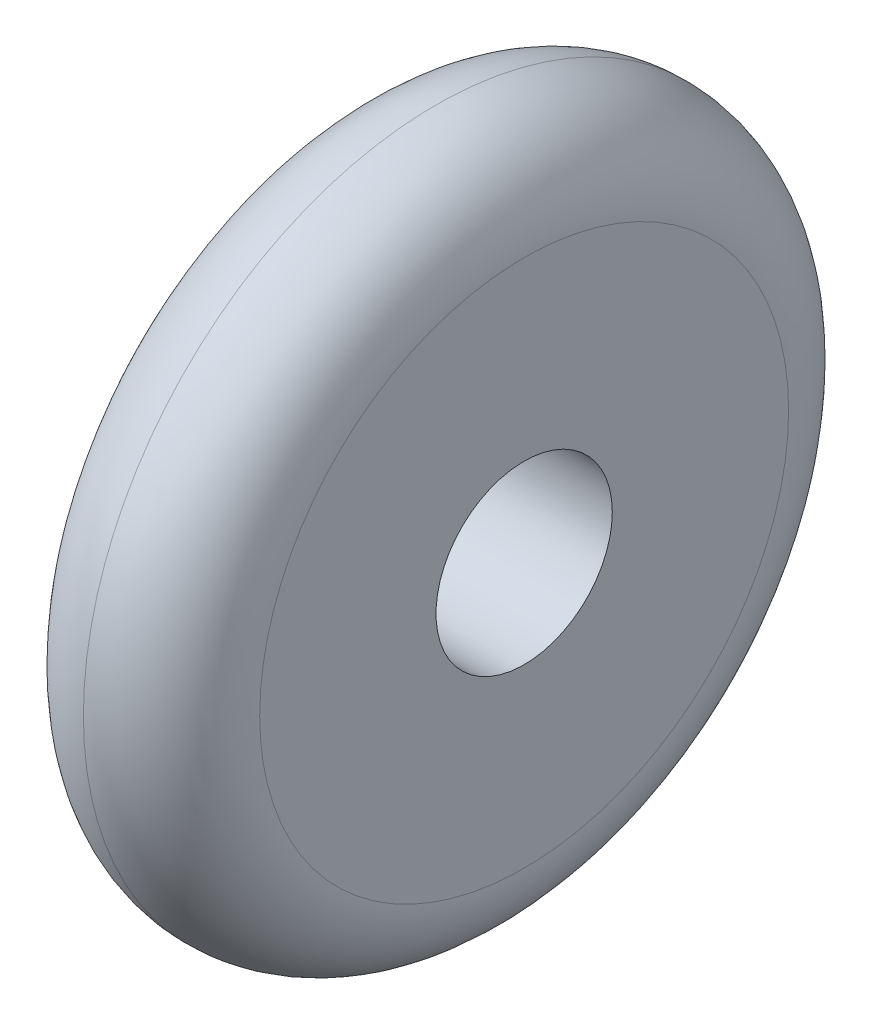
ISO-10303-21;
HEADER;
FILE_DESCRIPTION(('STEP AP214'),'2;1');
FILE_NAME('part.step','',(''),(''),'','','');
FILE_SCHEMA(('AUTOMOTIVE_DESIGN { 1 0 10303 214 1 1 1 1 }'));
ENDSEC;
DATA;
#1=APPLICATION_CONTEXT('core data for automotive mechanical design processes');
#2=APPLICATION_PROTOCOL_DEFINITION('international standard','automotive_design',2000,#1);
#3=PRODUCT_CONTEXT('',#1,'mechanical');
#4=PRODUCT('Part','Part','',(#3));
#5=PRODUCT_RELATED_PRODUCT_CATEGORY('part','',(#4));
#6=PRODUCT_DEFINITION_FORMATION('','',#4);
#7=PRODUCT_DEFINITION_CONTEXT('part definition',#1,'design');
#8=PRODUCT_DEFINITION('design','',#6,#7);
#9=PRODUCT_DEFINITION_SHAPE('','',#8);
#10=(LENGTH_UNIT() NAMED_UNIT(*) SI_UNIT(.MILLI.,.METRE.));
#11=(NAMED_UNIT(*) PLANE_ANGLE_UNIT() SI_UNIT($,.RADIAN.));
#12=(NAMED_UNIT(*) SI_UNIT($,.STERADIAN.) SOLID_ANGLE_UNIT());
#13=UNCERTAINTY_MEASURE_WITH_UNIT(LENGTH_MEASURE(1.E-05),#10,'distance_accuracy_value','');
#14=(GEOMETRIC_REPRESENTATION_CONTEXT(3) GLOBAL_UNCERTAINTY_ASSIGNED_CONTEXT((#13)) GLOBAL_UNIT_ASSIGNED_CONTEXT((#10,
#11,#12)) REPRESENTATION_CONTEXT('',''));
#15=CARTESIAN_POINT('',(0.,0.,0.));
#16=DIRECTION('',(0.,0.,1.));
#17=DIRECTION('',(1.,0.,0.));
#18=AXIS2_PLACEMENT_3D('',#15,#16,#17);
#19=CARTESIAN_POINT('',(6.35,0.,0.));
#20=DIRECTION('',(1.,0.,0.));
#21=DIRECTION('',(0.,0.,-1.));
#22=AXIS2_PLACEMENT_3D('',#19,#20,#21);
#23=PLANE('',#22);
#24=CARTESIAN_POINT('',(6.35,0.,0.));
#25=DIRECTION('',(1.,0.,0.));
#26=DIRECTION('',(0.,0.,-1.));
#27=AXIS2_PLACEMENT_3D('',#24,#25,#26);
#28=CIRCLE('',#27,19.05);
#29=CARTESIAN_POINT('',(6.35,0.,-19.05));
#30=VERTEX_POINT('',#29);
#31=EDGE_CURVE('E10',#30,#30,#28,.T.);
#32=ORIENTED_EDGE('',*,*,#31,.T.);
#33=EDGE_LOOP('',(#32));
#34=FACE_BOUND('',#33,.T.);
#35=CARTESIAN_POINT('',(6.35,0.,0.));
#36=DIRECTION('',(1.,0.,0.));
#37=DIRECTION('',(0.,0.,-1.));
#38=AXIS2_PLACEMENT_3D('',#35,#36,#37);
#39=CIRCLE('',#38,6.35);
#40=CARTESIAN_POINT('',(6.35,0.,-6.35));
#41=VERTEX_POINT('',#40);
#42=EDGE_CURVE('E51',#41,#41,#39,.T.);
#43=ORIENTED_EDGE('',*,*,#42,.F.);
#44=EDGE_LOOP('',(#43));
#45=FACE_BOUND('',#44,.T.);
#46=ADVANCED_FACE('F39',(#34,#45),#23,.T.);
#47=CARTESIAN_POINT('',(-6.35,0.,0.));
#48=DIRECTION('',(1.,0.,0.));
#49=DIRECTION('',(0.,0.,-1.));
#50=AXIS2_PLACEMENT_3D('',#47,#48,#49);
#51=PLANE('',#50);
#52=CARTESIAN_POINT('',(-6.35,0.,0.));
#53=DIRECTION('',(1.,0.,0.));
#54=DIRECTION('',(0.,0.,-1.));
#55=AXIS2_PLACEMENT_3D('',#52,#53,#54);
#56=CIRCLE('',#55,19.05);
#57=CARTESIAN_POINT('',(-6.35,0.,-19.05));
#58=VERTEX_POINT('',#57);
#59=EDGE_CURVE('E47',#58,#58,#56,.F.);
#60=ORIENTED_EDGE('',*,*,#59,.T.);
#61=EDGE_LOOP('',(#60));
#62=FACE_BOUND('',#61,.T.);
#63=CARTESIAN_POINT('',(-6.35,0.,0.));
#64=DIRECTION('',(1.,0.,0.));
#65=DIRECTION('',(0.,0.,-1.));
#66=AXIS2_PLACEMENT_3D('',#63,#64,#65);
#67=CIRCLE('',#66,6.35);
#68=CARTESIAN_POINT('',(-6.35,0.,-6.35));
#69=VERTEX_POINT('',#68);
#70=EDGE_CURVE('E54',#69,#69,#67,.T.);
#71=ORIENTED_EDGE('',*,*,#70,.T.);
#72=EDGE_LOOP('',(#71));
#73=FACE_BOUND('',#72,.T.);
#74=ADVANCED_FACE('F64',(#62,#73),#51,.F.);
#75=CARTESIAN_POINT('',(6.35,0.,0.));
#76=DIRECTION('',(-1.,0.,0.));
#77=DIRECTION('',(0.,0.,1.));
#78=AXIS2_PLACEMENT_3D('',#75,#76,#77);
#79=CYLINDRICAL_SURFACE('',#78,6.35);
#80=ORIENTED_EDGE('',*,*,#42,.T.);
#81=EDGE_LOOP('',(#80));
#82=FACE_BOUND('',#81,.T.);
#83=ORIENTED_EDGE('',*,*,#70,.F.);
#84=EDGE_LOOP('',(#83));
#85=FACE_BOUND('',#84,.T.);
#86=ADVANCED_FACE('F60',(#82,#85),#79,.F.);
#87=CARTESIAN_POINT('',(0.,0.,0.));
#88=DIRECTION('',(1.,0.,0.));
#89=DIRECTION('',(0.,0.,-1.));
#90=AXIS2_PLACEMENT_3D('',#87,#88,#89);
#91=TOROIDAL_SURFACE('',#90,19.05,6.35);
#92=ORIENTED_EDGE('',*,*,#31,.F.);
#93=EDGE_LOOP('',(#92));
#94=FACE_BOUND('',#93,.T.);
#95=CARTESIAN_POINT('',(0.,0.,0.));
#96=DIRECTION('',(1.,0.,0.));
#97=DIRECTION('',(0.,0.,-1.));
#98=AXIS2_PLACEMENT_3D('',#95,#96,#97);
#99=CIRCLE('',#98,25.4);
#100=CARTESIAN_POINT('',(0.,0.,-25.4));
#101=VERTEX_POINT('',#100);
#102=EDGE_CURVE('E43',#101,#101,#99,.F.);
#103=ORIENTED_EDGE('',*,*,#102,.F.);
#104=EDGE_LOOP('',(#103));
#105=FACE_BOUND('',#104,.T.);
#106=ADVANCED_FACE('F41',(#94,#105),#91,.T.);
#107=CARTESIAN_POINT('',(0.,0.,0.));
#108=DIRECTION('',(1.,0.,0.));
#109=DIRECTION('',(0.,0.,-1.));
#110=AXIS2_PLACEMENT_3D('',#107,#108,#109);
#111=TOROIDAL_SURFACE('',#110,19.05,6.35);
#112=ORIENTED_EDGE('',*,*,#59,.F.);
#113=EDGE_LOOP('',(#112));
#114=FACE_BOUND('',#113,.T.);
#115=ORIENTED_EDGE('',*,*,#102,.T.);
#116=EDGE_LOOP('',(#115));
#117=FACE_BOUND('',#116,.T.);
#118=ADVANCED_FACE('F73',(#114,#117),#111,.T.);
#119=CLOSED_SHELL('',(#46,#74,#86,#106,#118));
#120=MANIFOLD_SOLID_BREP('B2',#119);
#121=ADVANCED_BREP_SHAPE_REPRESENTATION('',(#18,#120),#14);
#122=SHAPE_DEFINITION_REPRESENTATION(#9,#121);
ENDSEC;
END-ISO-10303-21;
